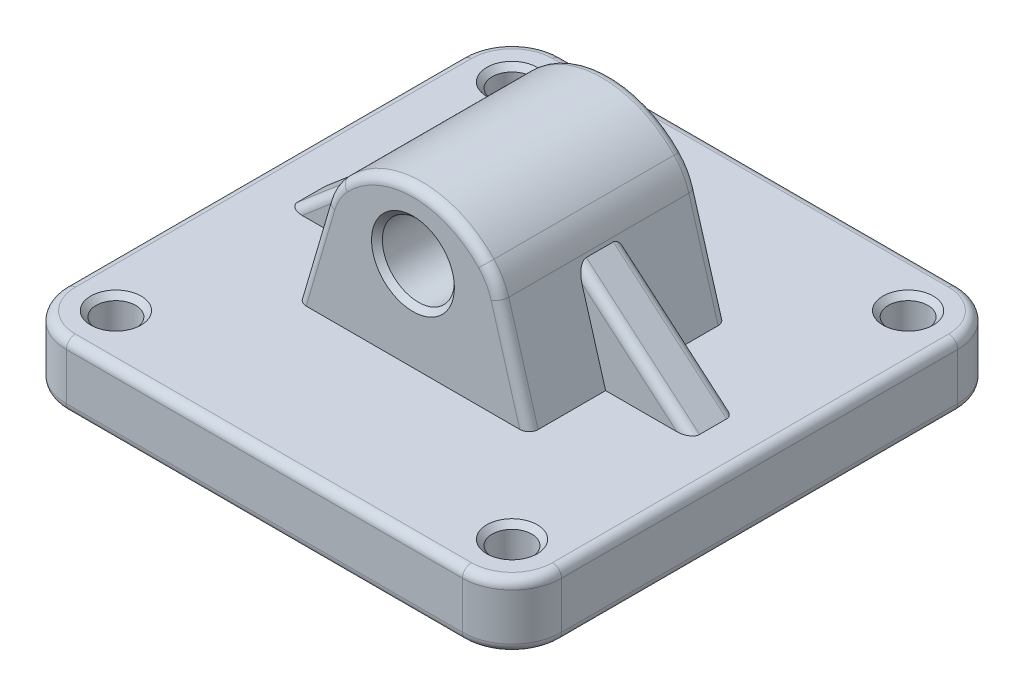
from build123d import *

# Parameters (mm, degrees)
IZIM2_R                     = 11
Y_KSEKLIK_EKSTR_ZYON1_DEPTH = 36
IZIM20_R                    = 105
KES_EKSTR_ZYON3_DEPTH       = 15
KES_EKSTR_ZYON3_DRAFT       = -22
IZIM21_R                    = 20
Y_KSEKLIK_EKSTR_ZYON2_DEPTH = 110
FEDER1_REACH                = 232.09
IZIM24_WALL_W               = 544.871424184
IZIM24_WALL_H               = 25
RADYUS1_R                   = 5
PAH1_SIZE                   = 3


with BuildPart() as part:
    # izim2 → Y_kseklik-Ekstr_zyon1 (new body)
    with BuildSketch(Plane(origin=(0, 0, 0), x_dir=(1, 0, 0), z_dir=(0, 1, 0))):
        with BuildLine():
            Line((-137.5, 110), (-137.5, -110))
            ThreePointArc((-137.5, -110), (-129.445436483, -129.445436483), (-110, -137.5))
            Line((-110, -137.5), (110, -137.5))
            ThreePointArc((110, -137.5), (129.445436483, -129.445436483), (137.5, -110))
            Line((137.5, -110), (137.5, 110))
            ThreePointArc((137.5, 110), (129.445436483, 129.445436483), (110, 137.5))
            Line((110, 137.5), (-110, 137.5))
            ThreePointArc((-110, 137.5), (-129.445436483, 129.445436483), (-137.5, 110))
        make_face()
        with Locations(Location((-110, 110, 0), (0, 0, 270))):
            Circle(IZIM2_R, mode=Mode.SUBTRACT)
        with Locations(Location((110, 110, 0), (0, 0, 90))):
            Circle(IZIM2_R, mode=Mode.SUBTRACT)
        with Locations(Location((110, -110, 0), (0, 0, 270))):
            Circle(IZIM2_R, mode=Mode.SUBTRACT)
        with Locations(Location((-110, -110, 0), (0, 0, 90))):
            Circle(IZIM2_R, mode=Mode.SUBTRACT)
    extrude(amount=Y_KSEKLIK_EKSTR_ZYON1_DEPTH)


with BuildPart() as kes_ekstr_zyon3_tool:
    # izim20 → Kes-Ekstr_zyon3 (with draft: the straight prism first)
    with BuildSketch(Plane.XZ):
        Circle(IZIM20_R)
    extrude(amount=-KES_EKSTR_ZYON3_DEPTH)
    # Kes-Ekstr_zyon3: the draft: its side faces are tilted about the plane it starts from
    kes_ekstr_zyon3_sides = [kes_ekstr_zyon3_tool.faces().sort_by_distance(p)[0] for p in [
        (-105, 7.5, 0),
    ]]
    draft(kes_ekstr_zyon3_sides, Plane.XZ, KES_EKSTR_ZYON3_DRAFT)


with BuildPart() as part_1:
    add(part.part)

    # Kes-Ekstr_zyon3: cut by kes_ekstr_zyon3_tool
    add(kes_ekstr_zyon3_tool.part, mode=Mode.SUBTRACT)

    # izim21 → Y_kseklik-Ekstr_zyon2 (add)
    with BuildSketch(Plane.XY.offset(55)):
        with BuildLine():
            Line((-64.5, 36), (64.5, 36))
            Line((64.5, 36), (48.217614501, 91.551668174))
            ThreePointArc((48.217614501, 91.551668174), (44.97354796, 99.151584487), (40.038136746, 105.779133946))
            ThreePointArc((40.038136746, 105.779133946), (0, 123), (-40.038136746, 105.779133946))
            ThreePointArc((-40.038136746, 105.779133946), (-44.97354796, 99.151584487), (-48.217614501, 91.551668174))
            Line((-48.217614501, 91.551668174), (-64.5, 36))
        make_face()
        with Locations((0, 86)):
            Circle(IZIM21_R, mode=Mode.SUBTRACT)
    extrude(amount=-Y_KSEKLIK_EKSTR_ZYON2_DEPTH)

    # izim24 wall → Feder1 (add, up to next)
    with BuildSketch(Plane(origin=(80.228489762, 62.83106123, 0), x_dir=(0.760833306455, -0.64894736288, 0), z_dir=(0.64894736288, 0.760833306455, 0)), mode=Mode.PRIVATE) as feder1_sk1:
        Rectangle(IZIM24_WALL_W, IZIM24_WALL_H)
    feder1_tool1 = extrude(feder1_sk1.sketch, amount=-FEDER1_REACH, mode=Mode.PRIVATE) - part_1.part
    feder1 = feder1_tool1.solids().sort_by_distance((80.228489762, 62.83106123, 0))[0]
    add(feder1)

    # Aynalama1: Feder1 across plane
    add(feder1.mirror(Plane(origin=(0, 0, 0), x_dir=(0, 0, 1), z_dir=(1, 0, 0))))

    # Radyus1
    radyus1_edges = [part_1.edges().sort_by_distance(p)[0] for p in [
        (-129.445436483, 36, 129.445436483),
        (-137.5, 0, 0),
        (-129.445436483, 0, -129.445436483),
        (-80.228489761, 62.831061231, -12.5),
        (0, 36, 137.5),
        (-80.228489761, 62.831061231, 12.5),
        (129.445436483, 36, 129.445436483),
        (137.5, 36, 0),
        (129.445436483, 36, -129.445436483),
        (0, 36, -137.5),
        (-129.445436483, 36, -129.445436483),
        (56.35880725, 63.775834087, -55),
        (-56.35880725, 63.775834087, -55),
        (-44.97354796, 99.151584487, -55),
        (0, 123, -55),
        (44.97354796, 99.151584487, -55),
        (56.35880725, 63.775834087, 55),
        (44.97354796, 99.151584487, 55),
        (0, 123, 55),
        (-44.97354796, 99.151584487, 55),
        (-56.35880725, 63.775834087, 55),
        (-137.5, 36, 0),
        (0, 0, -137.5),
        (129.445436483, 0, -129.445436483),
        (80.228489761, 62.831061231, 12.5),
        (137.5, 0, 0),
        (129.445436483, 0, 129.445436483),
        (80.228489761, 62.831061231, -12.5),
        (0, 0, 137.5),
        (-129.445436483, 0, 129.445436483),
    ]]
    fillet(radyus1_edges, radius=RADYUS1_R)

    # Pah1
    pah1_edges = [part_1.edges().sort_by_distance(p)[0] for p in [
        (-110, 0, -121),
        (-110, 36, -121),
        (110, 0, -99),
        (110, 36, -99),
        (110, 0, 99),
        (110, 36, 99),
        (-110, 0, 121),
        (-110, 36, 121),
        (-20, 86, -55),
        (-20, 86, 55),
    ]]
    chamfer(pah1_edges, length=PAH1_SIZE)


solid = part_1.part
